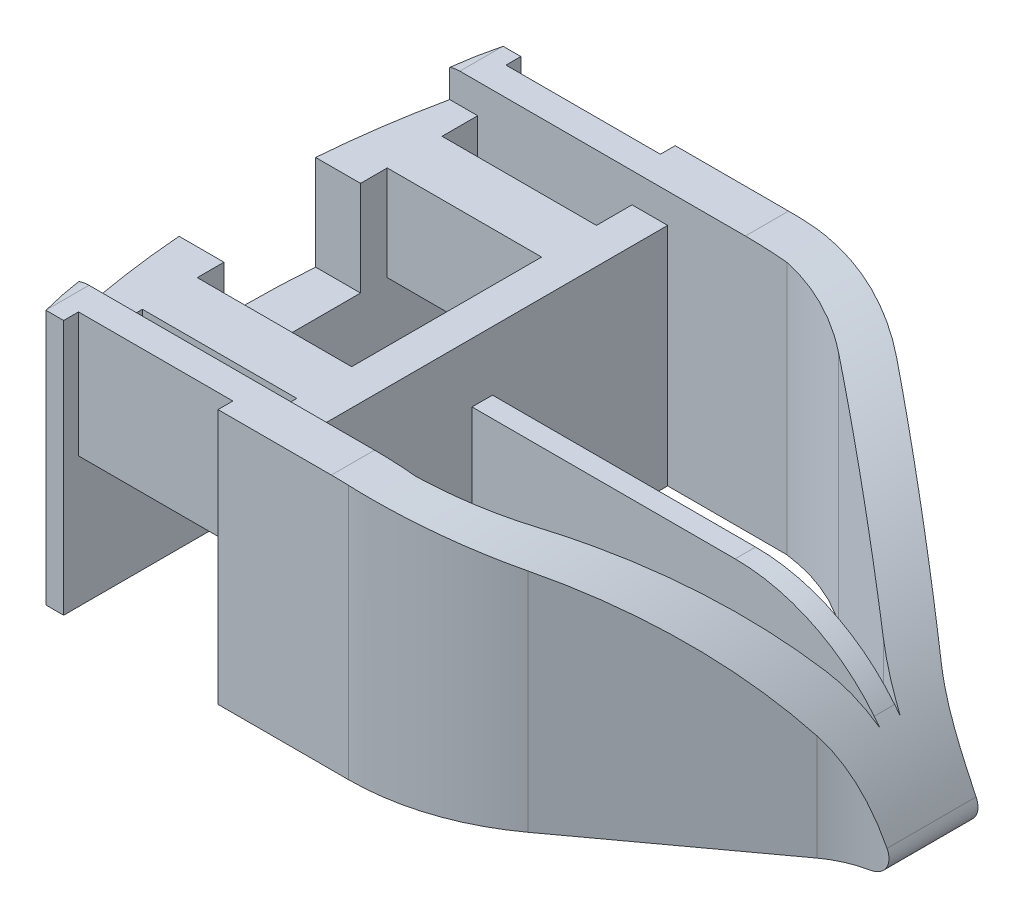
from build123d import *

# Parameters (mm, degrees)
EXTRUSION1_DEPTH        = 38.5
ENL_V_MAT_EXTRU_1_DEPTH = 130.56562044
ENL_V_MAT_EXTRU_2_DEPTH = 130.565620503
ESQUISSE4_W             = 26
ESQUISSE4_H             = 6
ESQUISSE4_H_2           = 32
ENL_V_MAT_EXTRU_3_DEPTH = 130.565620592
ENL_V_MAT_EXTRU_4_REACH = 131.566
ENL_V_MAT_EXTRU_5_REACH = 102.276
ESQUISSE6_W             = 62.46623696
ESQUISSE6_H             = 5
ESQUISSE7_W             = 3.446334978
ESQUISSE7_H             = 10
ENL_V_MAT_EXTRU_6_DEPTH = 96.431913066
CONG_1_R                = 30
ESQUISSE8_W             = 26
ESQUISSE8_H             = 2.5
ENL_V_MAT_EXTRU_7_DEPTH = 130.565620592


with BuildPart() as part:
    # Esquisse1 → Extrusion1 (new, symmetric)
    with BuildSketch(Plane.XY):
        with BuildLine():
            Line((34, 0), (113, 0))
            ThreePointArc((113, 0), (115.552435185, 1.423588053), (115.682459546, 4.343283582))
            ThreePointArc((115.682459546, 4.343283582), (89.874682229, 32.556820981), (53.091736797, 43))
            Line((53.091736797, 43), (5, 43))
            ThreePointArc((5, 43), (1.464466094, 41.535533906), (0, 38))
            Line((0, 38), (0, 0))
            Line((0, 0), (8, 0))
            Line((8, 0), (8, 22))
            Line((8, 22), (34, 22))
            Line((34, 22), (34, 0))
        make_face()
    extrude(amount=EXTRUSION1_DEPTH, both=True)

    # Esquisse2 → Enl_v. mat.-Extru.1 (cut, through all)
    with BuildSketch(Plane(origin=(0, 43, 0), x_dir=(-1, 0, 0), z_dir=(0, 1, 0))):
        with BuildLine():
            Line((-5.025002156, -38.5), (0, -38.5))
            Line((0, -38.5), (0, 0))
            ThreePointArc((0, 0), (-1.261555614, -19.413272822), (-5.025002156, -38.5))
        make_face()
    enl_v_mat_extru_1 = extrude(amount=-ENL_V_MAT_EXTRU_1_DEPTH, mode=Mode.SUBTRACT)

    # Esquisse3 → Enl_v. mat.-Extru.2 (cut, through all)
    with BuildSketch(Plane(origin=(0, 43, 0), x_dir=(-1, 0, 0), z_dir=(0, 1, 0))):
        with BuildLine():
            Line((-78.741504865, -31.065639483), (-106.84432921, -10.493054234))
            ThreePointArc((-106.84432921, -10.493054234), (-111.183759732, -8.267253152), (-116, -7.5))
            Line((-116, -7.5), (-116, -38.5))
            Line((-116, -38.5), (-56, -38.5))
            ThreePointArc((-56, -38.5), (-67.962919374, -36.594242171), (-78.741504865, -31.065639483))
        make_face()
    enl_v_mat_extru_2 = extrude(amount=-ENL_V_MAT_EXTRU_2_DEPTH, mode=Mode.SUBTRACT)

    # Sym_trie1: Enl_v. mat.-Extru.1, Enl_v. mat.-Extru.2 across plane
    add(enl_v_mat_extru_1.mirror(Plane.XY), mode=Mode.SUBTRACT)
    add(enl_v_mat_extru_2.mirror(Plane.XY), mode=Mode.SUBTRACT)

    # Esquisse4 → Enl_v. mat.-Extru.3 (cut, through all)
    with BuildSketch(Plane(origin=(0, 43, 0), x_dir=(-1, 0, 0), z_dir=(0, 1, 0))):
        with BuildLine():
            Line((-108.682459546, -1.723167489), (-40, -1.723167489))
            Line((-40, -1.723167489), (-40, -31.23311848))
            Line((-40, -31.23311848), (-60.091736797, -31.23311848))
            ThreePointArc((-60.091736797, -31.23311848), (-67.715818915, -29.240204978), (-74.606685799, -25.417341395))
            Line((-74.606685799, -25.417341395), (-102.709510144, -4.844756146))
            ThreePointArc((-102.709510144, -4.844756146), (-105.578445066, -3.059057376), (-108.682459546, -1.723167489))
        make_face()
        with BuildLine():
            Line((-108.682459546, 1.723167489), (-40, 1.723167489))
            Line((-40, 1.723167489), (-40, 31.23311848))
            Line((-40, 31.23311848), (-60.091736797, 31.23311848))
            ThreePointArc((-60.091736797, 31.23311848), (-67.715818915, 29.240204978), (-74.606685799, 25.417341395))
            Line((-74.606685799, 25.417341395), (-102.709510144, 4.844756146))
            ThreePointArc((-102.709510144, 4.844756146), (-105.578445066, 3.059057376), (-108.682459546, 1.723167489))
        make_face()
        with Locations((-21, -28.23311848)):
            Rectangle(ESQUISSE4_W, ESQUISSE4_H)
        with Locations((-21, 0)):
            Rectangle(ESQUISSE4_W, ESQUISSE4_H_2)
        with Locations((-21, 28.23311848)):
            Rectangle(ESQUISSE4_W, ESQUISSE4_H)
    extrude(amount=-ENL_V_MAT_EXTRU_3_DEPTH, mode=Mode.SUBTRACT)

    # Enl_v. mat.-Extru.4: up to this face of the body (flat: up to its plane)
    enl_v_mat_extru_4_end = Plane(part.part.faces().sort_by_distance((34, 18.588235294, 0))[0])
    # Esquisse5 → Enl_v. mat.-Extru.4 (cut, up to the picked face)
    with BuildSketch(Plane(origin=(0, 0, 0), x_dir=(0, 0, -1), z_dir=(1, 0, 0)), mode=Mode.PRIVATE) as enl_v_mat_extru_4_sk1:
        Polygon((11.5, 22), (-11.5, 22), (-11.5, 38), (-31.23311848, 38), (-31.23311848, 43), (31.23311848, 43), (31.23311848, 38), (11.5, 38), align=None)
    enl_v_mat_extru_4_tool1 = split(extrude(enl_v_mat_extru_4_sk1.sketch, amount=ENL_V_MAT_EXTRU_4_REACH, mode=Mode.PRIVATE), bisect_by=enl_v_mat_extru_4_end, keep=Keep.BOTH, mode=Mode.PRIVATE)
    add(enl_v_mat_extru_4_tool1.solids().sort_by(Axis((0, 34.820413, 0), (1, 0, 0)))[0], mode=Mode.SUBTRACT)

    # Esquisse6 → Enl_v. mat.-Extru.5 (cut, up to next)
    with BuildSketch(Plane.ZY.offset(-34), mode=Mode.PRIVATE) as enl_v_mat_extru_5_sk1:
        with Locations((0, 40.5)):
            Rectangle(ESQUISSE6_W, ESQUISSE6_H)
    enl_v_mat_extru_5_tool1 = extrude(enl_v_mat_extru_5_sk1.sketch, amount=-ENL_V_MAT_EXTRU_5_REACH, mode=Mode.PRIVATE) & part.part
    add(enl_v_mat_extru_5_tool1.solids().sort_by_distance((34, 40.5, 0))[0], mode=Mode.SUBTRACT)

    # Esquisse7 → Enl_v. mat.-Extru.6 (cut, through all)
    with BuildSketch(Plane(origin=(40, 0, 0), x_dir=(0, 0, -1), z_dir=(1, 0, 0))):
        with Locations((0, 33)):
            Rectangle(ESQUISSE7_W, ESQUISSE7_H)
    extrude(amount=ENL_V_MAT_EXTRU_6_DEPTH, mode=Mode.SUBTRACT)

    # Cong_1
    cong_1_edges = [part.edges().sort_by_distance(p)[0] for p in [
        (96.393006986, 28, 0),
    ]]
    fillet(cong_1_edges, radius=CONG_1_R)

    # Esquisse8 → Enl_v. mat.-Extru.7 (cut, through all)
    with BuildSketch(Plane(origin=(0, 43, 0), x_dir=(-1, 0, 0), z_dir=(0, 1, 0))):
        with Locations((-21, -37.25)):
            Rectangle(ESQUISSE8_W, ESQUISSE8_H)
        with Locations((-21, 37.25)):
            Rectangle(ESQUISSE8_W, ESQUISSE8_H)
    extrude(amount=-ENL_V_MAT_EXTRU_7_DEPTH, mode=Mode.SUBTRACT)


solid = part.part
